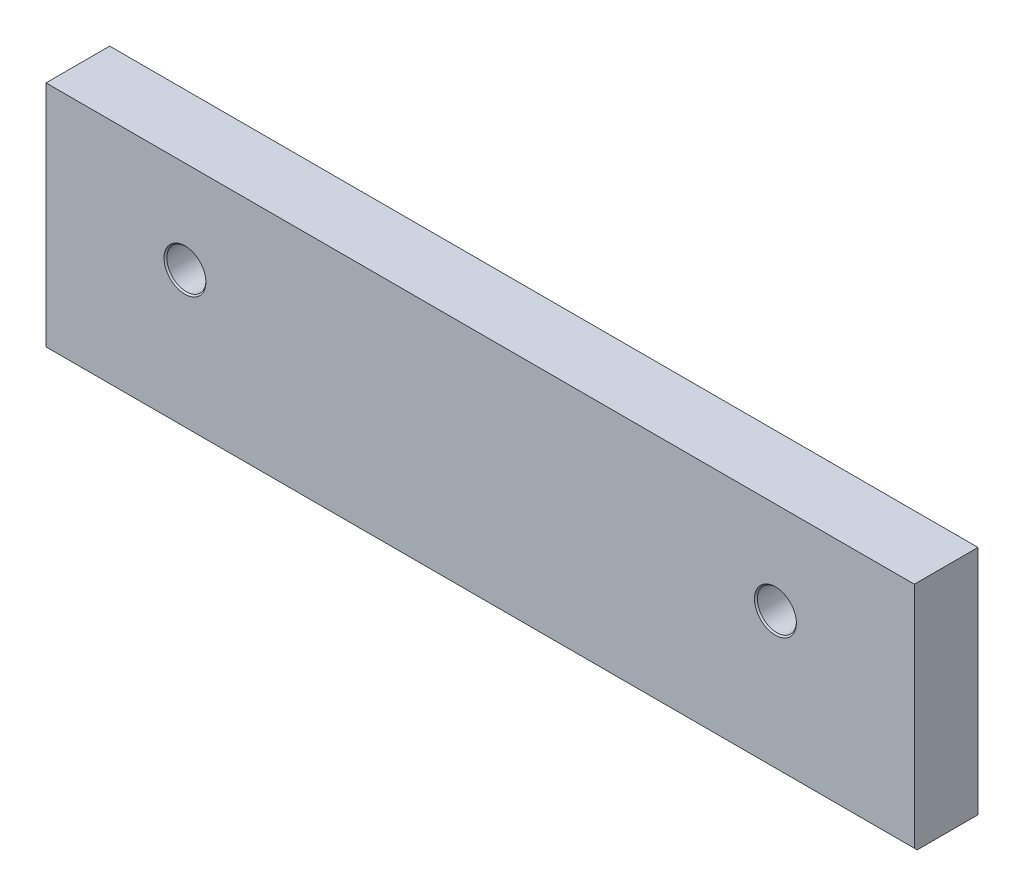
ISO-10303-21;
HEADER;
FILE_DESCRIPTION(('STEP AP214'),'2;1');
FILE_NAME('part.step','',(''),(''),'','','');
FILE_SCHEMA(('AUTOMOTIVE_DESIGN { 1 0 10303 214 1 1 1 1 }'));
ENDSEC;
DATA;
#1=APPLICATION_CONTEXT('core data for automotive mechanical design processes');
#2=APPLICATION_PROTOCOL_DEFINITION('international standard','automotive_design',2000,#1);
#3=PRODUCT_CONTEXT('',#1,'mechanical');
#4=PRODUCT('Part','Part','',(#3));
#5=PRODUCT_RELATED_PRODUCT_CATEGORY('part','',(#4));
#6=PRODUCT_DEFINITION_FORMATION('','',#4);
#7=PRODUCT_DEFINITION_CONTEXT('part definition',#1,'design');
#8=PRODUCT_DEFINITION('design','',#6,#7);
#9=PRODUCT_DEFINITION_SHAPE('','',#8);
#10=(LENGTH_UNIT() NAMED_UNIT(*) SI_UNIT(.MILLI.,.METRE.));
#11=(NAMED_UNIT(*) PLANE_ANGLE_UNIT() SI_UNIT($,.RADIAN.));
#12=(NAMED_UNIT(*) SI_UNIT($,.STERADIAN.) SOLID_ANGLE_UNIT());
#13=UNCERTAINTY_MEASURE_WITH_UNIT(LENGTH_MEASURE(1.E-05),#10,'distance_accuracy_value','');
#14=(GEOMETRIC_REPRESENTATION_CONTEXT(3) GLOBAL_UNCERTAINTY_ASSIGNED_CONTEXT((#13)) GLOBAL_UNIT_ASSIGNED_CONTEXT((#10,
#11,#12)) REPRESENTATION_CONTEXT('',''));
#15=CARTESIAN_POINT('',(0.,0.,0.));
#16=DIRECTION('',(0.,0.,1.));
#17=DIRECTION('',(1.,0.,0.));
#18=AXIS2_PLACEMENT_3D('',#15,#16,#17);
#19=CARTESIAN_POINT('',(0.,0.,-11.));
#20=DIRECTION('',(-1.,0.,0.));
#21=DIRECTION('',(0.,0.,1.));
#22=AXIS2_PLACEMENT_3D('',#19,#20,#21);
#23=PLANE('',#22);
#24=DIRECTION('',(0.,0.,1.));
#25=VECTOR('',#24,1.);
#26=CARTESIAN_POINT('',(0.,0.,-11.));
#27=LINE('',#26,#25);
#28=CARTESIAN_POINT('',(0.,0.,-11.));
#29=VERTEX_POINT('',#28);
#30=CARTESIAN_POINT('',(0.,0.,-0.5));
#31=VERTEX_POINT('',#30);
#32=EDGE_CURVE('E432',#29,#31,#27,.T.);
#33=ORIENTED_EDGE('',*,*,#32,.T.);
#34=DIRECTION('',(0.,0.707106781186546,0.707106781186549));
#35=VECTOR('',#34,1.);
#36=CARTESIAN_POINT('',(0.,-5.25,-5.75000000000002));
#37=LINE('',#36,#35);
#38=CARTESIAN_POINT('',(0.,0.5,0.));
#39=VERTEX_POINT('',#38);
#40=EDGE_CURVE('E439',#31,#39,#37,.T.);
#41=ORIENTED_EDGE('',*,*,#40,.T.);
#42=DIRECTION('',(0.,-1.,0.));
#43=VECTOR('',#42,1.);
#44=CARTESIAN_POINT('',(0.,0.,0.));
#45=LINE('',#44,#43);
#46=CARTESIAN_POINT('',(0.,40.,0.));
#47=VERTEX_POINT('',#46);
#48=EDGE_CURVE('E405',#47,#39,#45,.T.);
#49=ORIENTED_EDGE('',*,*,#48,.F.);
#50=DIRECTION('',(0.,0.,1.));
#51=VECTOR('',#50,1.);
#52=CARTESIAN_POINT('',(0.,40.,-11.));
#53=LINE('',#52,#51);
#54=CARTESIAN_POINT('',(0.,40.,-11.));
#55=VERTEX_POINT('',#54);
#56=EDGE_CURVE('E415',#55,#47,#53,.T.);
#57=ORIENTED_EDGE('',*,*,#56,.F.);
#58=DIRECTION('',(0.,-1.,0.));
#59=VECTOR('',#58,1.);
#60=CARTESIAN_POINT('',(0.,0.,-11.));
#61=LINE('',#60,#59);
#62=EDGE_CURVE('E420',#55,#29,#61,.T.);
#63=ORIENTED_EDGE('',*,*,#62,.T.);
#64=EDGE_LOOP('',(#33,#41,#49,#57,#63));
#65=FACE_BOUND('',#64,.T.);
#66=ADVANCED_FACE('F351',(#65),#23,.T.);
#67=CARTESIAN_POINT('',(0.,40.,-11.));
#68=DIRECTION('',(0.,1.,0.));
#69=DIRECTION('',(0.,0.,1.));
#70=AXIS2_PLACEMENT_3D('',#67,#68,#69);
#71=PLANE('',#70);
#72=DIRECTION('',(-1.,0.,0.));
#73=VECTOR('',#72,1.);
#74=CARTESIAN_POINT('',(0.,40.,0.));
#75=LINE('',#74,#73);
#76=CARTESIAN_POINT('',(150.,40.,0.));
#77=VERTEX_POINT('',#76);
#78=EDGE_CURVE('E402',#77,#47,#75,.T.);
#79=ORIENTED_EDGE('',*,*,#78,.F.);
#80=DIRECTION('',(0.,0.,1.));
#81=VECTOR('',#80,1.);
#82=CARTESIAN_POINT('',(150.,40.,-11.));
#83=LINE('',#82,#81);
#84=CARTESIAN_POINT('',(150.,40.,-11.));
#85=VERTEX_POINT('',#84);
#86=EDGE_CURVE('E408',#85,#77,#83,.T.);
#87=ORIENTED_EDGE('',*,*,#86,.F.);
#88=DIRECTION('',(-1.,0.,0.));
#89=VECTOR('',#88,1.);
#90=CARTESIAN_POINT('',(0.,40.,-11.));
#91=LINE('',#90,#89);
#92=EDGE_CURVE('E430',#85,#55,#91,.T.);
#93=ORIENTED_EDGE('',*,*,#92,.T.);
#94=ORIENTED_EDGE('',*,*,#56,.T.);
#95=EDGE_LOOP('',(#79,#87,#93,#94));
#96=FACE_BOUND('',#95,.T.);
#97=ADVANCED_FACE('F418',(#96),#71,.T.);
#98=CARTESIAN_POINT('',(150.,0.,-11.));
#99=DIRECTION('',(1.,0.,0.));
#100=DIRECTION('',(0.,0.,-1.));
#101=AXIS2_PLACEMENT_3D('',#98,#99,#100);
#102=PLANE('',#101);
#103=DIRECTION('',(0.,1.,0.));
#104=VECTOR('',#103,1.);
#105=CARTESIAN_POINT('',(150.,0.,0.));
#106=LINE('',#105,#104);
#107=CARTESIAN_POINT('',(150.,0.5,0.));
#108=VERTEX_POINT('',#107);
#109=EDGE_CURVE('E397',#108,#77,#106,.T.);
#110=ORIENTED_EDGE('',*,*,#109,.F.);
#111=DIRECTION('',(0.,-0.707106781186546,-0.707106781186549));
#112=VECTOR('',#111,1.);
#113=CARTESIAN_POINT('',(150.,-5.25,-5.75000000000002));
#114=LINE('',#113,#112);
#115=CARTESIAN_POINT('',(150.,0.,-0.5));
#116=VERTEX_POINT('',#115);
#117=EDGE_CURVE('E373',#108,#116,#114,.T.);
#118=ORIENTED_EDGE('',*,*,#117,.T.);
#119=DIRECTION('',(0.,0.,1.));
#120=VECTOR('',#119,1.);
#121=CARTESIAN_POINT('',(150.,0.,-11.));
#122=LINE('',#121,#120);
#123=CARTESIAN_POINT('',(150.,0.,-11.));
#124=VERTEX_POINT('',#123);
#125=EDGE_CURVE('E416',#124,#116,#122,.T.);
#126=ORIENTED_EDGE('',*,*,#125,.F.);
#127=DIRECTION('',(0.,1.,0.));
#128=VECTOR('',#127,1.);
#129=CARTESIAN_POINT('',(150.,0.,-11.));
#130=LINE('',#129,#128);
#131=EDGE_CURVE('E411',#124,#85,#130,.T.);
#132=ORIENTED_EDGE('',*,*,#131,.T.);
#133=ORIENTED_EDGE('',*,*,#86,.T.);
#134=EDGE_LOOP('',(#110,#118,#126,#132,#133));
#135=FACE_BOUND('',#134,.T.);
#136=ADVANCED_FACE('F409',(#135),#102,.T.);
#137=CARTESIAN_POINT('',(0.,0.,-11.));
#138=DIRECTION('',(0.,-1.,0.));
#139=DIRECTION('',(0.,0.,-1.));
#140=AXIS2_PLACEMENT_3D('',#137,#138,#139);
#141=PLANE('',#140);
#142=ORIENTED_EDGE('',*,*,#125,.T.);
#143=DIRECTION('',(-1.,0.,0.));
#144=VECTOR('',#143,1.);
#145=CARTESIAN_POINT('',(0.,0.,-0.5));
#146=LINE('',#145,#144);
#147=EDGE_CURVE('E365',#116,#31,#146,.T.);
#148=ORIENTED_EDGE('',*,*,#147,.T.);
#149=ORIENTED_EDGE('',*,*,#32,.F.);
#150=DIRECTION('',(1.,0.,0.));
#151=VECTOR('',#150,1.);
#152=CARTESIAN_POINT('',(0.,0.,-11.));
#153=LINE('',#152,#151);
#154=EDGE_CURVE('E423',#29,#124,#153,.T.);
#155=ORIENTED_EDGE('',*,*,#154,.T.);
#156=EDGE_LOOP('',(#142,#148,#149,#155));
#157=FACE_BOUND('',#156,.T.);
#158=ADVANCED_FACE('F475',(#157),#141,.T.);
#159=CARTESIAN_POINT('',(0.,40.,-11.));
#160=DIRECTION('',(0.,0.,-1.));
#161=DIRECTION('',(-1.,0.,0.));
#162=AXIS2_PLACEMENT_3D('',#159,#160,#161);
#163=PLANE('',#162);
#164=CARTESIAN_POINT('',(24.,24.,-11.));
#165=DIRECTION('',(0.,0.,-1.));
#166=DIRECTION('',(-1.,0.,0.));
#167=AXIS2_PLACEMENT_3D('',#164,#165,#166);
#168=CIRCLE('',#167,3.625);
#169=CARTESIAN_POINT('',(20.375,24.,-11.));
#170=VERTEX_POINT('',#169);
#171=EDGE_CURVE('E456',#170,#170,#168,.F.);
#172=ORIENTED_EDGE('',*,*,#171,.T.);
#173=EDGE_LOOP('',(#172));
#174=FACE_BOUND('',#173,.T.);
#175=CARTESIAN_POINT('',(126.,24.,-11.));
#176=DIRECTION('',(0.,0.,-1.));
#177=DIRECTION('',(-1.,0.,0.));
#178=AXIS2_PLACEMENT_3D('',#175,#176,#177);
#179=CIRCLE('',#178,3.62499999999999);
#180=CARTESIAN_POINT('',(122.375,24.,-11.));
#181=VERTEX_POINT('',#180);
#182=EDGE_CURVE('E453',#181,#181,#179,.F.);
#183=ORIENTED_EDGE('',*,*,#182,.T.);
#184=EDGE_LOOP('',(#183));
#185=FACE_BOUND('',#184,.T.);
#186=ORIENTED_EDGE('',*,*,#62,.F.);
#187=ORIENTED_EDGE('',*,*,#92,.F.);
#188=ORIENTED_EDGE('',*,*,#131,.F.);
#189=ORIENTED_EDGE('',*,*,#154,.F.);
#190=EDGE_LOOP('',(#186,#187,#188,#189));
#191=FACE_BOUND('',#190,.T.);
#192=ADVANCED_FACE('F472',(#174,#185,#191),#163,.T.);
#193=CARTESIAN_POINT('',(0.,40.,0.));
#194=DIRECTION('',(0.,0.,-1.));
#195=DIRECTION('',(-1.,0.,0.));
#196=AXIS2_PLACEMENT_3D('',#193,#194,#195);
#197=PLANE('',#196);
#198=CARTESIAN_POINT('',(24.,24.,0.));
#199=DIRECTION('',(0.,0.,-1.));
#200=DIRECTION('',(-1.,0.,0.));
#201=AXIS2_PLACEMENT_3D('',#198,#199,#200);
#202=CIRCLE('',#201,3.625);
#203=CARTESIAN_POINT('',(20.375,24.,0.));
#204=VERTEX_POINT('',#203);
#205=EDGE_CURVE('E447',#204,#204,#202,.T.);
#206=ORIENTED_EDGE('',*,*,#205,.T.);
#207=EDGE_LOOP('',(#206));
#208=FACE_BOUND('',#207,.T.);
#209=CARTESIAN_POINT('',(126.,24.,0.));
#210=DIRECTION('',(0.,0.,-1.));
#211=DIRECTION('',(-1.,0.,0.));
#212=AXIS2_PLACEMENT_3D('',#209,#210,#211);
#213=CIRCLE('',#212,3.62499999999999);
#214=CARTESIAN_POINT('',(122.375,24.,0.));
#215=VERTEX_POINT('',#214);
#216=EDGE_CURVE('E444',#215,#215,#213,.T.);
#217=ORIENTED_EDGE('',*,*,#216,.T.);
#218=EDGE_LOOP('',(#217));
#219=FACE_BOUND('',#218,.T.);
#220=ORIENTED_EDGE('',*,*,#48,.T.);
#221=DIRECTION('',(1.,0.,0.));
#222=VECTOR('',#221,1.);
#223=CARTESIAN_POINT('',(150.,0.5,0.));
#224=LINE('',#223,#222);
#225=EDGE_CURVE('E404',#39,#108,#224,.T.);
#226=ORIENTED_EDGE('',*,*,#225,.T.);
#227=ORIENTED_EDGE('',*,*,#109,.T.);
#228=ORIENTED_EDGE('',*,*,#78,.T.);
#229=EDGE_LOOP('',(#220,#226,#227,#228));
#230=FACE_BOUND('',#229,.T.);
#231=ADVANCED_FACE('F400',(#208,#219,#230),#197,.F.);
#232=CARTESIAN_POINT('',(126.,24.,-11.));
#233=DIRECTION('',(0.,0.,1.));
#234=DIRECTION('',(1.,0.,0.));
#235=AXIS2_PLACEMENT_3D('',#232,#233,#234);
#236=CYLINDRICAL_SURFACE('',#235,3.37499999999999);
#237=CARTESIAN_POINT('',(126.,24.,-10.75));
#238=DIRECTION('',(0.,0.,-1.));
#239=DIRECTION('',(-1.,0.,0.));
#240=AXIS2_PLACEMENT_3D('',#237,#238,#239);
#241=CIRCLE('',#240,3.37499999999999);
#242=CARTESIAN_POINT('',(122.625,24.,-10.75));
#243=VERTEX_POINT('',#242);
#244=EDGE_CURVE('E11',#243,#243,#241,.T.);
#245=ORIENTED_EDGE('',*,*,#244,.T.);
#246=EDGE_LOOP('',(#245));
#247=FACE_BOUND('',#246,.T.);
#248=CARTESIAN_POINT('',(126.,24.,-0.25));
#249=DIRECTION('',(0.,0.,-1.));
#250=DIRECTION('',(-1.,0.,0.));
#251=AXIS2_PLACEMENT_3D('',#248,#249,#250);
#252=CIRCLE('',#251,3.37499999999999);
#253=CARTESIAN_POINT('',(122.625,24.,-0.25));
#254=VERTEX_POINT('',#253);
#255=EDGE_CURVE('E450',#254,#254,#252,.F.);
#256=ORIENTED_EDGE('',*,*,#255,.T.);
#257=EDGE_LOOP('',(#256));
#258=FACE_BOUND('',#257,.T.);
#259=ADVANCED_FACE('F494',(#247,#258),#236,.F.);
#260=CARTESIAN_POINT('',(24.,24.,-11.));
#261=DIRECTION('',(0.,0.,1.));
#262=DIRECTION('',(1.,0.,0.));
#263=AXIS2_PLACEMENT_3D('',#260,#261,#262);
#264=CYLINDRICAL_SURFACE('',#263,3.375);
#265=CARTESIAN_POINT('',(24.,24.,-10.75));
#266=DIRECTION('',(0.,0.,-1.));
#267=DIRECTION('',(-1.,0.,0.));
#268=AXIS2_PLACEMENT_3D('',#265,#266,#267);
#269=CIRCLE('',#268,3.375);
#270=CARTESIAN_POINT('',(20.625,24.,-10.75));
#271=VERTEX_POINT('',#270);
#272=EDGE_CURVE('E358',#271,#271,#269,.T.);
#273=ORIENTED_EDGE('',*,*,#272,.T.);
#274=EDGE_LOOP('',(#273));
#275=FACE_BOUND('',#274,.T.);
#276=CARTESIAN_POINT('',(24.,24.,-0.25));
#277=DIRECTION('',(0.,0.,-1.));
#278=DIRECTION('',(-1.,0.,0.));
#279=AXIS2_PLACEMENT_3D('',#276,#277,#278);
#280=CIRCLE('',#279,3.375);
#281=CARTESIAN_POINT('',(20.625,24.,-0.25));
#282=VERTEX_POINT('',#281);
#283=EDGE_CURVE('E441',#282,#282,#280,.F.);
#284=ORIENTED_EDGE('',*,*,#283,.T.);
#285=EDGE_LOOP('',(#284));
#286=FACE_BOUND('',#285,.T.);
#287=ADVANCED_FACE('F461',(#275,#286),#264,.F.);
#288=CARTESIAN_POINT('',(0.,0.5,0.));
#289=DIRECTION('',(0.,-0.707106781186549,0.707106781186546));
#290=DIRECTION('',(0.,-0.707106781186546,-0.707106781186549));
#291=AXIS2_PLACEMENT_3D('',#288,#289,#290);
#292=PLANE('',#291);
#293=ORIENTED_EDGE('',*,*,#40,.F.);
#294=ORIENTED_EDGE('',*,*,#147,.F.);
#295=ORIENTED_EDGE('',*,*,#117,.F.);
#296=ORIENTED_EDGE('',*,*,#225,.F.);
#297=EDGE_LOOP('',(#293,#294,#295,#296));
#298=FACE_BOUND('',#297,.T.);
#299=ADVANCED_FACE('F484',(#298),#292,.T.);
#300=CARTESIAN_POINT('',(24.,24.,-0.25));
#301=DIRECTION('',(0.,0.,1.));
#302=DIRECTION('',(1.,0.,0.));
#303=AXIS2_PLACEMENT_3D('',#300,#301,#302);
#304=CONICAL_SURFACE('',#303,3.375,0.785398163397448);
#305=ORIENTED_EDGE('',*,*,#205,.F.);
#306=EDGE_LOOP('',(#305));
#307=FACE_BOUND('',#306,.T.);
#308=ORIENTED_EDGE('',*,*,#283,.F.);
#309=EDGE_LOOP('',(#308));
#310=FACE_BOUND('',#309,.T.);
#311=ADVANCED_FACE('F486',(#307,#310),#304,.F.);
#312=CARTESIAN_POINT('',(126.,24.,-0.25));
#313=DIRECTION('',(0.,0.,1.));
#314=DIRECTION('',(1.,0.,0.));
#315=AXIS2_PLACEMENT_3D('',#312,#313,#314);
#316=CONICAL_SURFACE('',#315,3.37499999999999,0.785398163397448);
#317=ORIENTED_EDGE('',*,*,#216,.F.);
#318=EDGE_LOOP('',(#317));
#319=FACE_BOUND('',#318,.T.);
#320=ORIENTED_EDGE('',*,*,#255,.F.);
#321=EDGE_LOOP('',(#320));
#322=FACE_BOUND('',#321,.T.);
#323=ADVANCED_FACE('F468',(#319,#322),#316,.F.);
#324=CARTESIAN_POINT('',(24.,24.,-11.));
#325=DIRECTION('',(0.,0.,-1.));
#326=DIRECTION('',(-1.,0.,0.));
#327=AXIS2_PLACEMENT_3D('',#324,#325,#326);
#328=CONICAL_SURFACE('',#327,3.625,0.785398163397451);
#329=ORIENTED_EDGE('',*,*,#272,.F.);
#330=EDGE_LOOP('',(#329));
#331=FACE_BOUND('',#330,.T.);
#332=ORIENTED_EDGE('',*,*,#171,.F.);
#333=EDGE_LOOP('',(#332));
#334=FACE_BOUND('',#333,.T.);
#335=ADVANCED_FACE('F464',(#331,#334),#328,.F.);
#336=CARTESIAN_POINT('',(126.,24.,-11.));
#337=DIRECTION('',(0.,0.,-1.));
#338=DIRECTION('',(-1.,0.,0.));
#339=AXIS2_PLACEMENT_3D('',#336,#337,#338);
#340=CONICAL_SURFACE('',#339,3.62499999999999,0.785398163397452);
#341=ORIENTED_EDGE('',*,*,#244,.F.);
#342=EDGE_LOOP('',(#341));
#343=FACE_BOUND('',#342,.T.);
#344=ORIENTED_EDGE('',*,*,#182,.F.);
#345=EDGE_LOOP('',(#344));
#346=FACE_BOUND('',#345,.T.);
#347=ADVANCED_FACE('F467',(#343,#346),#340,.F.);
#348=CLOSED_SHELL('',(#66,#97,#136,#158,#192,#231,#259,#287,#299,#311,#323,#335,#347));
#349=MANIFOLD_SOLID_BREP('B2',#348);
#350=ADVANCED_BREP_SHAPE_REPRESENTATION('',(#18,#349),#14);
#351=SHAPE_DEFINITION_REPRESENTATION(#9,#350);
ENDSEC;
END-ISO-10303-21;
